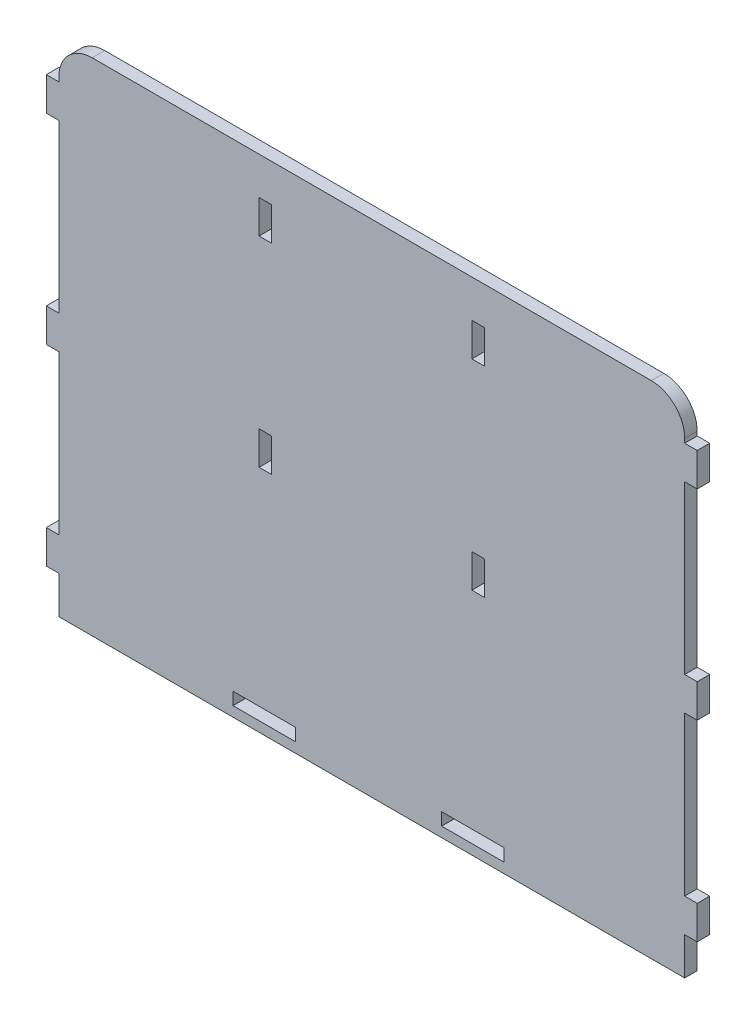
from build123d import *

# Parameters (mm, degrees)
SALIENTE_EXTRUIR1_DEPTH = 15
REDONDEO1_R             = 40
REDONDEO2_R             = 40
CORTAR_EXTRUIR1_REACH   = 717.769
CROQUIS2_W              = 15
CROQUIS2_H              = 40
CORTAR_EXTRUIR2_REACH   = 717.769
CROQUIS3_W              = 75
CROQUIS3_H              = 15


with BuildPart() as part:
    # Croquis1 → Saliente-Extruir1 (new body)
    with BuildSketch(Plane.XY):
        Polygon((-375, -45), (-390, -45), (-390, -85), (-375, -85), (-375, -285), (-390, -285), (-390, -325), (-375, -325), (-375, -515), (-390, -515), (-390, -555), (-375, -555), (-375, -600), (375, -600), (375, -555), (390, -555), (390, -515), (375, -515), (375, -325), (390, -325), (390, -285), (375, -285), (375, -85), (390, -85), (390, -45), (375, -45), (375, 0), (-375, 0), align=None)
    extrude(amount=SALIENTE_EXTRUIR1_DEPTH)

    # Redondeo1
    redondeo1_edges = [part.edges().sort_by_distance(p)[0] for p in [
        (-375, 0, 7.5),
    ]]
    fillet(redondeo1_edges, radius=REDONDEO1_R)

    # Redondeo2
    redondeo2_edges = [part.edges().sort_by_distance(p)[0] for p in [
        (375, 0, 7.5),
    ]]
    fillet(redondeo2_edges, radius=REDONDEO2_R)

    # Croquis2 → Cortar-Extruir1 (cut, up to next)
    with BuildSketch(Plane.XY.offset(15), mode=Mode.PRIVATE) as cortar_extruir1_sk1:
        with Locations((-127.5, -65)):
            Rectangle(CROQUIS2_W, CROQUIS2_H)
    cortar_extruir1_tool1 = extrude(cortar_extruir1_sk1.sketch, amount=-CORTAR_EXTRUIR1_REACH, mode=Mode.PRIVATE) & part.part
    # Croquis2 → Cortar-Extruir1 (cut, up to next)
    with BuildSketch(Plane.XY.offset(15), mode=Mode.PRIVATE) as cortar_extruir1_sk2:
        with Locations((127.5, -65)):
            Rectangle(CROQUIS2_W, CROQUIS2_H)
    cortar_extruir1_tool2 = extrude(cortar_extruir1_sk2.sketch, amount=-CORTAR_EXTRUIR1_REACH, mode=Mode.PRIVATE) & part.part
    # Croquis2 → Cortar-Extruir1 (cut, up to next)
    with BuildSketch(Plane.XY.offset(15), mode=Mode.PRIVATE) as cortar_extruir1_sk3:
        with Locations((-127.5, -305)):
            Rectangle(CROQUIS2_W, CROQUIS2_H)
    cortar_extruir1_tool3 = extrude(cortar_extruir1_sk3.sketch, amount=-CORTAR_EXTRUIR1_REACH, mode=Mode.PRIVATE) & part.part
    # Croquis2 → Cortar-Extruir1 (cut, up to next)
    with BuildSketch(Plane.XY.offset(15), mode=Mode.PRIVATE) as cortar_extruir1_sk4:
        with Locations((127.5, -305)):
            Rectangle(CROQUIS2_W, CROQUIS2_H)
    cortar_extruir1_tool4 = extrude(cortar_extruir1_sk4.sketch, amount=-CORTAR_EXTRUIR1_REACH, mode=Mode.PRIVATE) & part.part
    add(cortar_extruir1_tool1.solids().sort_by_distance((-127.5, -65, 15))[0], mode=Mode.SUBTRACT)
    add(cortar_extruir1_tool2.solids().sort_by_distance((127.5, -65, 15))[0], mode=Mode.SUBTRACT)
    add(cortar_extruir1_tool3.solids().sort_by_distance((-127.5, -305, 15))[0], mode=Mode.SUBTRACT)
    add(cortar_extruir1_tool4.solids().sort_by_distance((127.5, -305, 15))[0], mode=Mode.SUBTRACT)

    # Croquis3 → Cortar-Extruir2 (cut, up to next)
    with BuildSketch(Plane.XY.offset(15), mode=Mode.PRIVATE) as cortar_extruir2_sk1:
        with Locations((-128.75, -580.5)):
            Rectangle(CROQUIS3_W, CROQUIS3_H)
    cortar_extruir2_tool1 = extrude(cortar_extruir2_sk1.sketch, amount=-CORTAR_EXTRUIR2_REACH, mode=Mode.PRIVATE) & part.part
    # Croquis3 → Cortar-Extruir2 (cut, up to next)
    with BuildSketch(Plane.XY.offset(15), mode=Mode.PRIVATE) as cortar_extruir2_sk2:
        with Locations((121.25, -580.5)):
            Rectangle(CROQUIS3_W, CROQUIS3_H)
    cortar_extruir2_tool2 = extrude(cortar_extruir2_sk2.sketch, amount=-CORTAR_EXTRUIR2_REACH, mode=Mode.PRIVATE) & part.part
    add(cortar_extruir2_tool1.solids().sort_by_distance((-128.75, -580.5, 15))[0], mode=Mode.SUBTRACT)
    add(cortar_extruir2_tool2.solids().sort_by_distance((121.25, -580.5, 15))[0], mode=Mode.SUBTRACT)


solid = part.part
